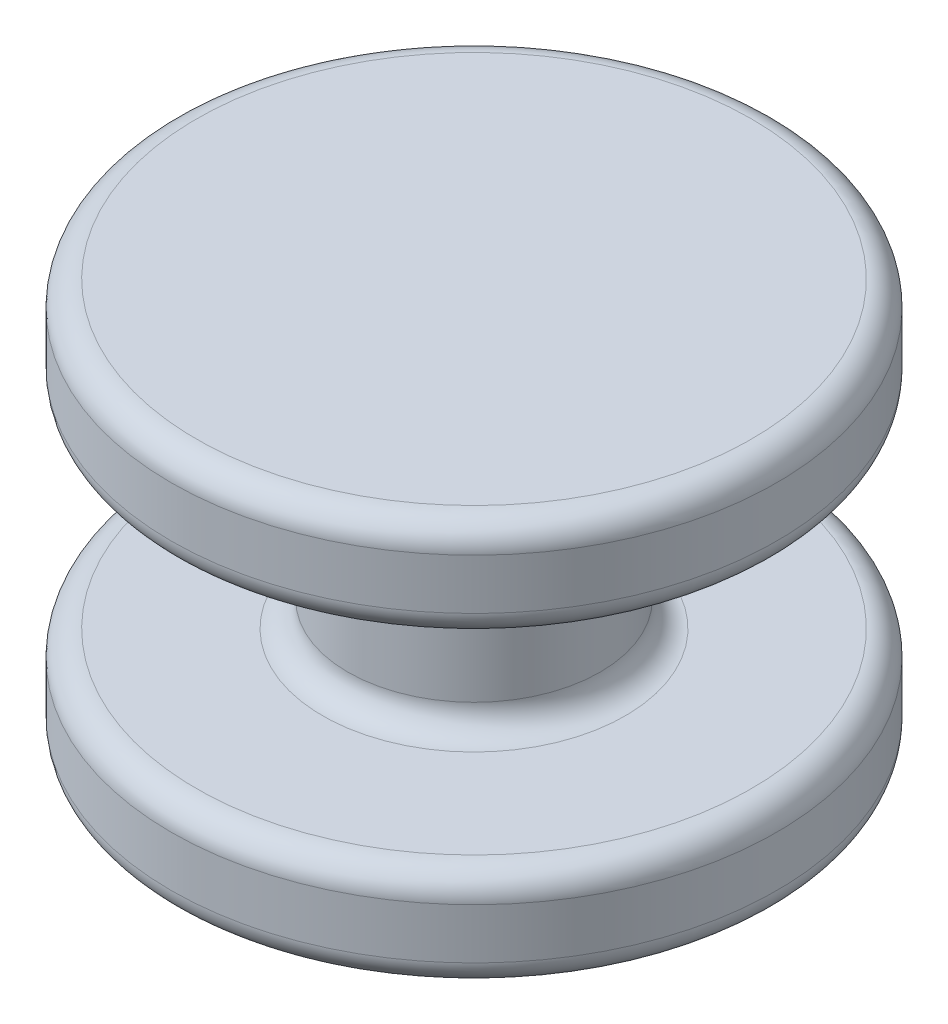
from build123d import *


with BuildPart() as part:
    # Sketch1 → Revolve1 (revolve)
    with BuildSketch(Plane.XY, mode=Mode.PRIVATE) as revolve1_sk:
        with BuildLine():
            Line((0, -4), (0, 4))
            Line((0, 4), (5.5, 4))
            ThreePointArc((5.5, 4), (5.853553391, 3.853553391), (6, 3.5))
            Line((6, 3.5), (6, 2.5))
            ThreePointArc((6, 2.5), (5.853553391, 2.146446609), (5.5, 2))
            Line((5.5, 2), (3, 2))
            ThreePointArc((3, 2), (2.646446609, 1.853553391), (2.5, 1.5))
            Line((2.5, 1.5), (2.5, -1.5))
            ThreePointArc((2.5, -1.5), (2.646446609, -1.853553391), (3, -2))
            Line((3, -2), (5.5, -2))
            ThreePointArc((5.5, -2), (5.853553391, -2.146446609), (6, -2.5))
            Line((6, -2.5), (6, -3.5))
            ThreePointArc((6, -3.5), (5.853553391, -3.853553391), (5.5, -4))
            Line((5.5, -4), (0, -4))
        make_face()
    revolve(revolve1_sk.sketch.rotate(Axis((0, -4, 0), (0, 1, 0)), 90), axis=Axis((0, -4, 0), (0, 1, 0)))


solid = part.part
